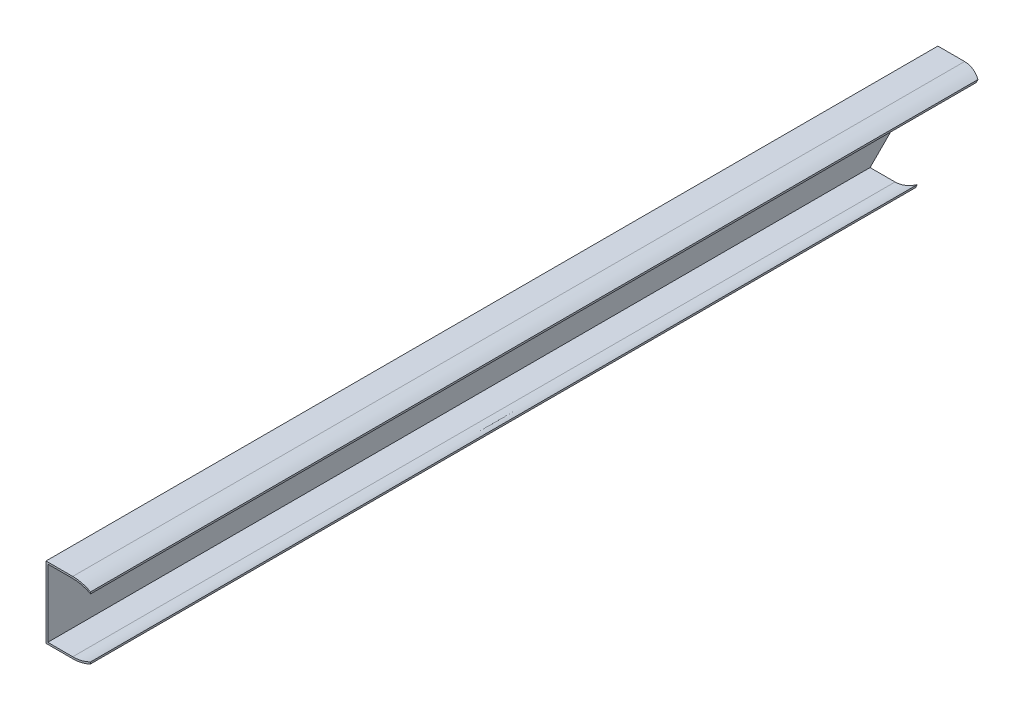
from build123d import *

# Parameters (mm, degrees)
EXTRUSION1_DEPTH = 1000
EXTRUSION5_REACH = 1006.44


with BuildPart() as part:
    # Esquisse1 → Extrusion1 (new body)
    with BuildSketch(Plane.XY):
        with BuildLine():
            Line((0, 0), (0, 80))
            Line((0, 80), (30, 80))
            add(Edge.make_bspline(
                [(30, 80), (40.603281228, 79.951543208), (50, 75)],
                knots=[0, 0, 0, 1, 1, 1], degree=2))
            Line((50, 75), (50, 73))
            add(Edge.make_bspline(
                [(30, 78), (40.603281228, 77.951543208), (50, 73)],
                knots=[0, 0, 0, 1, 1, 1], degree=2))
            Line((30, 78), (2, 78))
            Line((2, 78), (2, 2))
            Line((2, 2), (30, 2))
            add(Edge.make_bspline(
                [(30, 2), (40.603281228, 2.048456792), (50, 7)],
                knots=[0, 0, 0, 1, 1, 1], degree=2))
            Line((50, 7), (50, 5))
            add(Edge.make_bspline(
                [(30, 0), (40.603281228, 0.048456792), (50, 5)],
                knots=[0, 0, 0, 1, 1, 1], degree=2))
            Line((30, 0), (0, 0))
        make_face()
    extrude(amount=EXTRUSION1_DEPTH)

    # Esquisse4 → Extrusion5 (cut, up to next)
    with BuildSketch(Plane.ZY, mode=Mode.PRIVATE) as extrusion5_sk1:
        Polygon((0, 0), (80, 0), (0, 80), align=None)
    extrusion5_tool1 = extrude(extrusion5_sk1.sketch, amount=-EXTRUSION5_REACH, mode=Mode.PRIVATE) & part.part
    add(extrusion5_tool1.solids().sort_by_distance((0, 26.666667, 26.666667))[0], mode=Mode.SUBTRACT)


solid = part.part
